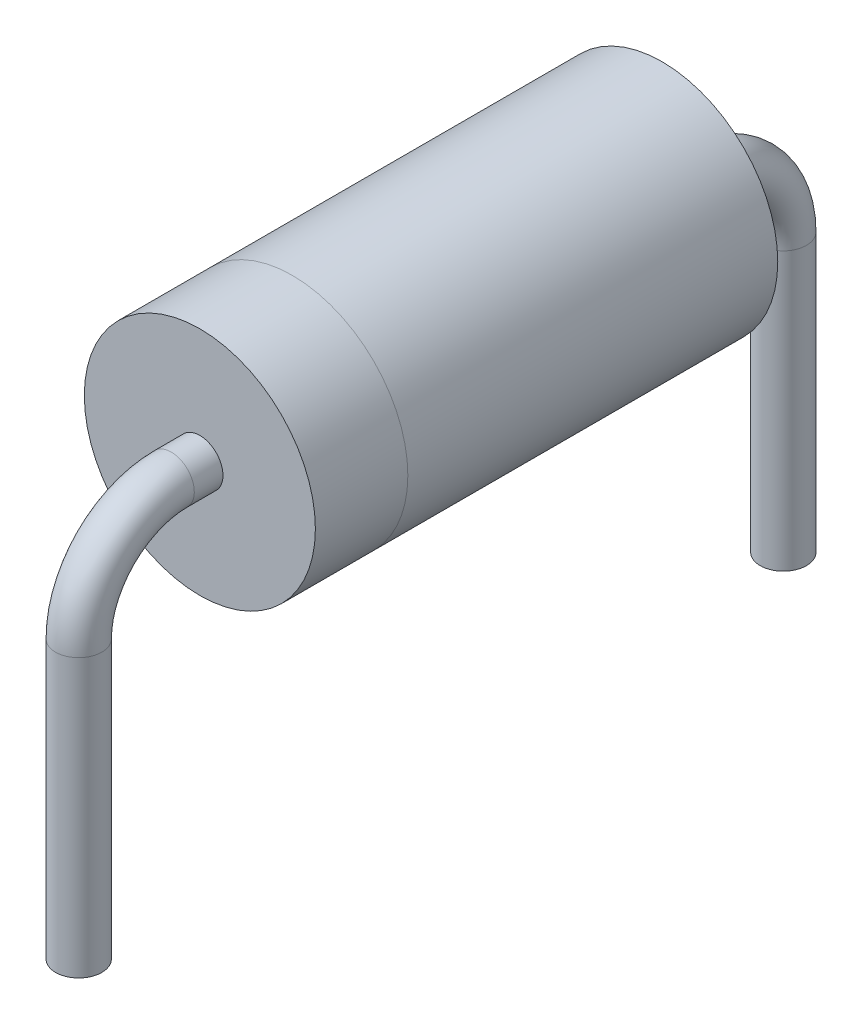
from build123d import *

# Parameters (mm, degrees)
ESQUISSE1_R        = 1.25
BOSS_EXTRU_1_DEPTH = 4
ESQUISSE2_R        = 1.2495
BOSS_EXTRU_2_DEPTH = 1
ESQUISSE4_R        = 0.25


with BuildPart() as part:
    # Esquisse1 → Boss.-Extru.1 (new body)
    with BuildSketch(Plane.XY):
        Circle(ESQUISSE1_R)
    extrude(amount=BOSS_EXTRU_1_DEPTH)

    # Esquisse2 → Boss.-Extru.2 (add)
    with BuildSketch(Plane.XY.offset(4)):
        Circle(ESQUISSE2_R)
    extrude(amount=BOSS_EXTRU_2_DEPTH)

    # Balayage1: sweep along a path in Esquisse3
    with BuildLine(Plane(origin=(0, 0, 0), x_dir=(0, 0, -1), z_dir=(1, 0, 0))) as balayage1_path:
        Line((-5, 0), (-5.31, 0))
        ThreePointArc((-5.31, 0), (-6.017106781, -0.292893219), (-6.31, -1))
        Line((-6.31, -1), (-6.31, -4))
    # Esquisse4 → Balayage1 (sweep)
    with BuildSketch(Plane.XY.offset(5)):
        Circle(ESQUISSE4_R)
    balayage1 = sweep(path=balayage1_path.line)

    # Sym_trie1: Balayage1 across plane
    add(balayage1.mirror(Plane.XY.offset(2.5)))


solid = part.part
